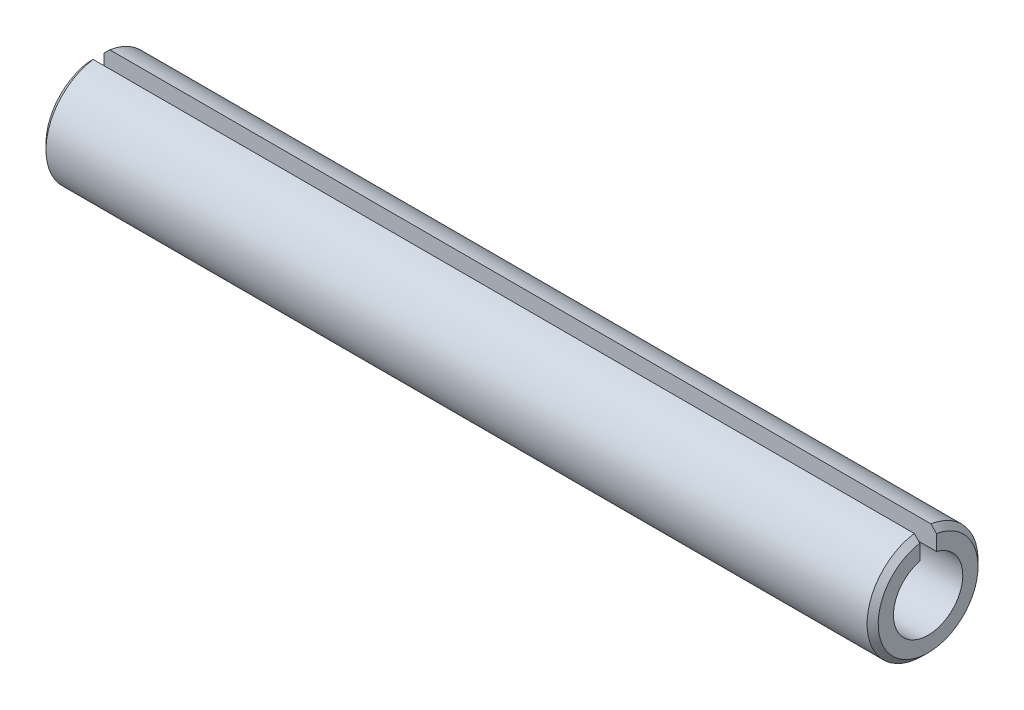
ISO-10303-21;
HEADER;
FILE_DESCRIPTION(('STEP AP214'),'2;1');
FILE_NAME('part.step','',(''),(''),'','','');
FILE_SCHEMA(('AUTOMOTIVE_DESIGN { 1 0 10303 214 1 1 1 1 }'));
ENDSEC;
DATA;
#1=APPLICATION_CONTEXT('core data for automotive mechanical design processes');
#2=APPLICATION_PROTOCOL_DEFINITION('international standard','automotive_design',2000,#1);
#3=PRODUCT_CONTEXT('',#1,'mechanical');
#4=PRODUCT('Part','Part','',(#3));
#5=PRODUCT_RELATED_PRODUCT_CATEGORY('part','',(#4));
#6=PRODUCT_DEFINITION_FORMATION('','',#4);
#7=PRODUCT_DEFINITION_CONTEXT('part definition',#1,'design');
#8=PRODUCT_DEFINITION('design','',#6,#7);
#9=PRODUCT_DEFINITION_SHAPE('','',#8);
#10=(LENGTH_UNIT() NAMED_UNIT(*) SI_UNIT(.MILLI.,.METRE.));
#11=(NAMED_UNIT(*) PLANE_ANGLE_UNIT() SI_UNIT($,.RADIAN.));
#12=(NAMED_UNIT(*) SI_UNIT($,.STERADIAN.) SOLID_ANGLE_UNIT());
#13=UNCERTAINTY_MEASURE_WITH_UNIT(LENGTH_MEASURE(1.E-05),#10,'distance_accuracy_value','');
#14=(GEOMETRIC_REPRESENTATION_CONTEXT(3) GLOBAL_UNCERTAINTY_ASSIGNED_CONTEXT((#13)) GLOBAL_UNIT_ASSIGNED_CONTEXT((#10,
#11,#12)) REPRESENTATION_CONTEXT('',''));
#15=CARTESIAN_POINT('',(0.,0.,0.));
#16=DIRECTION('',(0.,0.,1.));
#17=DIRECTION('',(1.,0.,0.));
#18=AXIS2_PLACEMENT_3D('',#15,#16,#17);
#19=CARTESIAN_POINT('',(0.,0.,0.));
#20=DIRECTION('',(-1.,0.,0.));
#21=DIRECTION('',(0.,0.,1.));
#22=AXIS2_PLACEMENT_3D('',#19,#20,#21);
#23=CYLINDRICAL_SURFACE('',#22,2.5);
#24=DIRECTION('',(-1.,0.,0.));
#25=VECTOR('',#24,1.);
#26=CARTESIAN_POINT('',(60.,2.42693221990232,0.6));
#27=LINE('',#26,#25);
#28=CARTESIAN_POINT('',(60.,2.42693221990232,0.6));
#29=VERTEX_POINT('',#28);
#30=CARTESIAN_POINT('',(0.,2.42693221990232,0.6));
#31=VERTEX_POINT('',#30);
#32=EDGE_CURVE('E45',#29,#31,#27,.T.);
#33=ORIENTED_EDGE('',*,*,#32,.F.);
#34=CARTESIAN_POINT('',(60.,0.,0.));
#35=DIRECTION('',(-1.,0.,0.));
#36=DIRECTION('',(0.,0.,1.));
#37=AXIS2_PLACEMENT_3D('',#34,#35,#36);
#38=CIRCLE('',#37,2.5);
#39=CARTESIAN_POINT('',(60.,2.42693221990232,-0.6));
#40=VERTEX_POINT('',#39);
#41=EDGE_CURVE('E87',#40,#29,#38,.T.);
#42=ORIENTED_EDGE('',*,*,#41,.F.);
#43=DIRECTION('',(-1.,0.,0.));
#44=VECTOR('',#43,1.);
#45=CARTESIAN_POINT('',(60.,2.42693221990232,-0.6));
#46=LINE('',#45,#44);
#47=CARTESIAN_POINT('',(0.,2.42693221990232,-0.6));
#48=VERTEX_POINT('',#47);
#49=EDGE_CURVE('E81',#40,#48,#46,.T.);
#50=ORIENTED_EDGE('',*,*,#49,.T.);
#51=CARTESIAN_POINT('',(0.,0.,0.));
#52=DIRECTION('',(-1.,0.,0.));
#53=DIRECTION('',(0.,0.,1.));
#54=AXIS2_PLACEMENT_3D('',#51,#52,#53);
#55=CIRCLE('',#54,2.5);
#56=EDGE_CURVE('E91',#48,#31,#55,.T.);
#57=ORIENTED_EDGE('',*,*,#56,.T.);
#58=EDGE_LOOP('',(#33,#42,#50,#57));
#59=FACE_BOUND('',#58,.T.);
#60=ADVANCED_FACE('F31',(#59),#23,.F.);
#61=CARTESIAN_POINT('',(60.,2.5,0.));
#62=DIRECTION('',(-1.,0.,0.));
#63=DIRECTION('',(0.,0.,1.));
#64=AXIS2_PLACEMENT_3D('',#61,#62,#63);
#65=PLANE('',#64);
#66=DIRECTION('',(0.,-1.,0.));
#67=VECTOR('',#66,1.);
#68=CARTESIAN_POINT('',(60.,3.95474398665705,0.6));
#69=LINE('',#68,#67);
#70=CARTESIAN_POINT('',(60.,3.54964786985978,0.6));
#71=VERTEX_POINT('',#70);
#72=EDGE_CURVE('E122',#71,#29,#69,.T.);
#73=ORIENTED_EDGE('',*,*,#72,.F.);
#74=CARTESIAN_POINT('',(60.,0.,0.));
#75=DIRECTION('',(-1.,0.,0.));
#76=DIRECTION('',(0.,0.,1.));
#77=AXIS2_PLACEMENT_3D('',#74,#75,#76);
#78=CIRCLE('',#77,3.60000000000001);
#79=CARTESIAN_POINT('',(60.,3.54964786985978,-0.6));
#80=VERTEX_POINT('',#79);
#81=EDGE_CURVE('E115',#80,#71,#78,.T.);
#82=ORIENTED_EDGE('',*,*,#81,.F.);
#83=DIRECTION('',(0.,-1.,0.));
#84=VECTOR('',#83,1.);
#85=CARTESIAN_POINT('',(60.,3.95474398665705,-0.6));
#86=LINE('',#85,#84);
#87=EDGE_CURVE('E123',#80,#40,#86,.T.);
#88=ORIENTED_EDGE('',*,*,#87,.T.);
#89=ORIENTED_EDGE('',*,*,#41,.T.);
#90=EDGE_LOOP('',(#73,#82,#88,#89));
#91=FACE_BOUND('',#90,.T.);
#92=ADVANCED_FACE('F120',(#91),#65,.F.);
#93=CARTESIAN_POINT('',(60.,0.,0.));
#94=DIRECTION('',(-1.,0.,0.));
#95=DIRECTION('',(0.,0.,1.));
#96=AXIS2_PLACEMENT_3D('',#93,#94,#95);
#97=CONICAL_SURFACE('',#96,3.60000000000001,0.785398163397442);
#98=CARTESIAN_POINT('',(57.8731044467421,5.6953781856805,0.6));
#99=CARTESIAN_POINT('',(58.0494236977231,5.51807770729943,0.6));
#100=CARTESIAN_POINT('',(58.2257027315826,5.34073717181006,0.6));
#101=CARTESIAN_POINT('',(58.5781365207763,4.98593500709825,0.6));
#102=CARTESIAN_POINT('',(58.7542912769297,4.8084733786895,0.6));
#103=CARTESIAN_POINT('',(59.1064277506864,4.45339301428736,0.6));
#104=CARTESIAN_POINT('',(59.2824094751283,4.27577428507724,0.6));
#105=CARTESIAN_POINT('',(59.6341356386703,3.92029946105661,0.6));
#106=CARTESIAN_POINT('',(59.809880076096,3.74244336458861,0.6));
#107=CARTESIAN_POINT('',(60.1610200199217,3.3863633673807,0.6));
#108=CARTESIAN_POINT('',(60.3364155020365,3.20813944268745,0.6));
#109=CARTESIAN_POINT('',(60.6866304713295,2.85113122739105,0.6));
#110=CARTESIAN_POINT('',(60.8614499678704,2.67234694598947,0.6));
#111=CARTESIAN_POINT('',(61.1229123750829,2.40341280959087,0.6));
#112=CARTESIAN_POINT('',(61.2099416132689,2.31363878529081,0.6));
#113=CARTESIAN_POINT('',(61.3836327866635,2.13373761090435,0.6));
#114=CARTESIAN_POINT('',(61.4702947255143,2.04361046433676,0.6));
#115=CARTESIAN_POINT('',(61.6430946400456,1.86284399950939,0.6));
#116=CARTESIAN_POINT('',(61.7292325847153,1.77220465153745,0.6));
#117=CARTESIAN_POINT('',(61.8578267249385,1.63566518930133,0.6));
#118=CARTESIAN_POINT('',(61.9005900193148,1.59005452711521,0.6));
#119=CARTESIAN_POINT('',(61.9858494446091,1.49858326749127,0.6));
#120=CARTESIAN_POINT('',(62.0283455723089,1.45272266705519,0.6));
#121=CARTESIAN_POINT('',(62.070676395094,1.40670916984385,0.6));
#122=B_SPLINE_CURVE_WITH_KNOTS('',3,(#98,#99,#100,#101,#102,#103,#104,#105,#106,#107,#108,#109,
#110,#111,#112,#113,#114,#115,#116,#117,#118,#119,#120,#121),.UNSPECIFIED.,.F.,.F.,(4,2,2,2,2,2,
2,2,2,2,2,4),(0.,0.750143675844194,1.50028235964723,2.2503900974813,3.0005031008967,
3.75066659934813,4.50081784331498,4.87591865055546,5.25101572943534,5.62613479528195,
5.81370060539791,6.00126867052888),.UNSPECIFIED.);
#123=CARTESIAN_POINT('',(59.6,3.95474398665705,0.6));
#124=VERTEX_POINT('',#123);
#125=EDGE_CURVE('E97',#124,#71,#122,.T.);
#126=ORIENTED_EDGE('',*,*,#125,.F.);
#127=CARTESIAN_POINT('',(59.6,0.,0.));
#128=DIRECTION('',(-1.,0.,0.));
#129=DIRECTION('',(0.,0.,1.));
#130=AXIS2_PLACEMENT_3D('',#127,#128,#129);
#131=CIRCLE('',#130,4.00000000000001);
#132=CARTESIAN_POINT('',(59.6,3.95474398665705,-0.6));
#133=VERTEX_POINT('',#132);
#134=EDGE_CURVE('E112',#133,#124,#131,.T.);
#135=ORIENTED_EDGE('',*,*,#134,.F.);
#136=CARTESIAN_POINT('',(57.8731044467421,5.6953781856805,-0.6));
#137=CARTESIAN_POINT('',(58.0494236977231,5.51807770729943,-0.6));
#138=CARTESIAN_POINT('',(58.2257027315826,5.34073717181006,-0.6));
#139=CARTESIAN_POINT('',(58.5781365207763,4.98593500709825,-0.6));
#140=CARTESIAN_POINT('',(58.7542912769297,4.8084733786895,-0.6));
#141=CARTESIAN_POINT('',(59.1064277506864,4.45339301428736,-0.6));
#142=CARTESIAN_POINT('',(59.2824094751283,4.27577428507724,-0.6));
#143=CARTESIAN_POINT('',(59.6341356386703,3.92029946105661,-0.6));
#144=CARTESIAN_POINT('',(59.809880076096,3.74244336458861,-0.6));
#145=CARTESIAN_POINT('',(60.1610200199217,3.3863633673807,-0.6));
#146=CARTESIAN_POINT('',(60.3364155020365,3.20813944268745,-0.6));
#147=CARTESIAN_POINT('',(60.6866304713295,2.85113122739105,-0.6));
#148=CARTESIAN_POINT('',(60.8614499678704,2.67234694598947,-0.6));
#149=CARTESIAN_POINT('',(61.1229123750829,2.40341280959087,-0.6));
#150=CARTESIAN_POINT('',(61.2099416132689,2.31363878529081,-0.6));
#151=CARTESIAN_POINT('',(61.3836327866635,2.13373761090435,-0.6));
#152=CARTESIAN_POINT('',(61.4702947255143,2.04361046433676,-0.6));
#153=CARTESIAN_POINT('',(61.6430946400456,1.86284399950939,-0.6));
#154=CARTESIAN_POINT('',(61.7292325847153,1.77220465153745,-0.6));
#155=CARTESIAN_POINT('',(61.8578267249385,1.63566518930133,-0.6));
#156=CARTESIAN_POINT('',(61.9005900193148,1.59005452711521,-0.6));
#157=CARTESIAN_POINT('',(61.9858494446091,1.49858326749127,-0.6));
#158=CARTESIAN_POINT('',(62.0283455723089,1.45272266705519,-0.6));
#159=CARTESIAN_POINT('',(62.070676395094,1.40670916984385,-0.6));
#160=B_SPLINE_CURVE_WITH_KNOTS('',3,(#136,#137,#138,#139,#140,#141,#142,#143,#144,#145,#146,
#147,#148,#149,#150,#151,#152,#153,#154,#155,#156,#157,#158,#159),.UNSPECIFIED.,.F.,.F.,(4,2,2,
2,2,2,2,2,2,2,2,4),(0.,0.750143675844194,1.50028235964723,2.2503900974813,3.0005031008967,
3.75066659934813,4.50081784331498,4.87591865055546,5.25101572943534,5.62613479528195,
5.81370060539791,6.00126867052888),.UNSPECIFIED.);
#161=EDGE_CURVE('E139',#133,#80,#160,.T.);
#162=ORIENTED_EDGE('',*,*,#161,.T.);
#163=ORIENTED_EDGE('',*,*,#81,.T.);
#164=EDGE_LOOP('',(#126,#135,#162,#163));
#165=FACE_BOUND('',#164,.T.);
#166=ADVANCED_FACE('F161',(#165),#97,.T.);
#167=CARTESIAN_POINT('',(0.,0.,0.));
#168=DIRECTION('',(-1.,0.,0.));
#169=DIRECTION('',(0.,0.,1.));
#170=AXIS2_PLACEMENT_3D('',#167,#168,#169);
#171=CYLINDRICAL_SURFACE('',#170,4.);
#172=DIRECTION('',(-1.,0.,0.));
#173=VECTOR('',#172,1.);
#174=CARTESIAN_POINT('',(60.,3.95474398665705,0.6));
#175=LINE('',#174,#173);
#176=CARTESIAN_POINT('',(0.4,3.95474398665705,0.6));
#177=VERTEX_POINT('',#176);
#178=EDGE_CURVE('E130',#124,#177,#175,.T.);
#179=ORIENTED_EDGE('',*,*,#178,.T.);
#180=CARTESIAN_POINT('',(0.399999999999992,0.,0.));
#181=DIRECTION('',(-1.,0.,0.));
#182=DIRECTION('',(0.,0.,1.));
#183=AXIS2_PLACEMENT_3D('',#180,#181,#182);
#184=CIRCLE('',#183,4.);
#185=CARTESIAN_POINT('',(0.4,3.95474398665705,-0.6));
#186=VERTEX_POINT('',#185);
#187=EDGE_CURVE('E99',#186,#177,#184,.T.);
#188=ORIENTED_EDGE('',*,*,#187,.F.);
#189=DIRECTION('',(-1.,0.,0.));
#190=VECTOR('',#189,1.);
#191=CARTESIAN_POINT('',(60.,3.95474398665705,-0.6));
#192=LINE('',#191,#190);
#193=EDGE_CURVE('E93',#133,#186,#192,.T.);
#194=ORIENTED_EDGE('',*,*,#193,.F.);
#195=ORIENTED_EDGE('',*,*,#134,.T.);
#196=EDGE_LOOP('',(#179,#188,#194,#195));
#197=FACE_BOUND('',#196,.T.);
#198=ADVANCED_FACE('F165',(#197),#171,.T.);
#199=CARTESIAN_POINT('',(0.399999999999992,0.,0.));
#200=DIRECTION('',(1.,0.,0.));
#201=DIRECTION('',(0.,0.,-1.));
#202=AXIS2_PLACEMENT_3D('',#199,#200,#201);
#203=CONICAL_SURFACE('',#202,4.,0.785398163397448);
#204=CARTESIAN_POINT('',(-2.07067639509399,1.40670916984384,0.6));
#205=CARTESIAN_POINT('',(-2.02011415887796,1.46166506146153,0.6));
#206=CARTESIAN_POINT('',(-1.9693200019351,1.51640610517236,0.6));
#207=CARTESIAN_POINT('',(-1.86736787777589,1.62554685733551,0.6));
#208=CARTESIAN_POINT('',(-1.81620991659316,1.67994657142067,0.6));
#209=CARTESIAN_POINT('',(-1.66234187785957,1.84276470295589,0.6));
#210=CARTESIAN_POINT('',(-1.55923365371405,1.95080641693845,0.6));
#211=CARTESIAN_POINT('',(-1.35237956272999,2.16626307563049,0.6));
#212=CARTESIAN_POINT('',(-1.24863373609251,2.27367805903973,0.6));
#213=CARTESIAN_POINT('',(-1.04071524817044,2.48809612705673,0.6));
#214=CARTESIAN_POINT('',(-0.9365425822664,2.59509920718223,0.6));
#215=CARTESIAN_POINT('',(-0.691507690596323,2.84610384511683,0.6));
#216=CARTESIAN_POINT('',(-0.550525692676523,2.98998839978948,0.6));
#217=CARTESIAN_POINT('',(-0.268216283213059,3.27742366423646,0.6));
#218=CARTESIAN_POINT('',(-0.126888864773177,3.42097436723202,0.6));
#219=CARTESIAN_POINT('',(0.190127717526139,3.74245168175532,0.6));
#220=CARTESIAN_POINT('',(0.365880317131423,3.92031572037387,0.6));
#221=CARTESIAN_POINT('',(0.717623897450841,4.2758078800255,0.6));
#222=CARTESIAN_POINT('',(0.89361487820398,4.45343600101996,0.6));
#223=CARTESIAN_POINT('',(1.24575266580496,4.80851768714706,0.6));
#224=CARTESIAN_POINT('',(1.42189946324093,4.9859712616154,0.6));
#225=CARTESIAN_POINT('',(1.77431596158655,5.34075596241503,0.6));
#226=CARTESIAN_POINT('',(1.95058566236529,5.51808708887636,0.6));
#227=CARTESIAN_POINT('',(2.1268955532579,5.69537818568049,0.6));
#228=B_SPLINE_CURVE_WITH_KNOTS('',3,(#204,#205,#206,#207,#208,#209,#210,#211,#212,#213,#214,
#215,#216,#217,#218,#219,#220,#221,#222,#223,#224,#225,#226,#227),.UNSPECIFIED.,.F.,.F.,(4,2,2,
2,2,2,2,2,2,2,2,4),(0.,0.224029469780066,0.448055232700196,0.896089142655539,1.3440950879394,
1.79210589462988,2.39642954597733,3.00076536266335,3.75091253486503,4.50105982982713,
5.25116454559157,6.00126846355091),.UNSPECIFIED.);
#229=CARTESIAN_POINT('',(0.,3.54964786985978,0.6));
#230=VERTEX_POINT('',#229);
#231=EDGE_CURVE('E101',#230,#177,#228,.T.);
#232=ORIENTED_EDGE('',*,*,#231,.F.);
#233=CARTESIAN_POINT('',(0.,0.,0.));
#234=DIRECTION('',(-1.,0.,0.));
#235=DIRECTION('',(0.,0.,1.));
#236=AXIS2_PLACEMENT_3D('',#233,#234,#235);
#237=CIRCLE('',#236,3.60000000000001);
#238=CARTESIAN_POINT('',(0.,3.54964786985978,-0.6));
#239=VERTEX_POINT('',#238);
#240=EDGE_CURVE('E96',#239,#230,#237,.T.);
#241=ORIENTED_EDGE('',*,*,#240,.F.);
#242=CARTESIAN_POINT('',(-2.07067639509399,1.40670916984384,-0.6));
#243=CARTESIAN_POINT('',(-2.02011415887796,1.46166506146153,-0.6));
#244=CARTESIAN_POINT('',(-1.9693200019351,1.51640610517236,-0.6));
#245=CARTESIAN_POINT('',(-1.86736787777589,1.62554685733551,-0.6));
#246=CARTESIAN_POINT('',(-1.81620991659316,1.67994657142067,-0.6));
#247=CARTESIAN_POINT('',(-1.66234187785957,1.84276470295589,-0.6));
#248=CARTESIAN_POINT('',(-1.55923365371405,1.95080641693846,-0.6));
#249=CARTESIAN_POINT('',(-1.35237956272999,2.16626307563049,-0.6));
#250=CARTESIAN_POINT('',(-1.24863373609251,2.27367805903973,-0.6));
#251=CARTESIAN_POINT('',(-1.04071524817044,2.48809612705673,-0.6));
#252=CARTESIAN_POINT('',(-0.9365425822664,2.59509920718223,-0.6));
#253=CARTESIAN_POINT('',(-0.691507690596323,2.84610384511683,-0.6));
#254=CARTESIAN_POINT('',(-0.550525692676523,2.98998839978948,-0.6));
#255=CARTESIAN_POINT('',(-0.268216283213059,3.27742366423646,-0.6));
#256=CARTESIAN_POINT('',(-0.126888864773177,3.42097436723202,-0.6));
#257=CARTESIAN_POINT('',(0.190127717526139,3.74245168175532,-0.6));
#258=CARTESIAN_POINT('',(0.365880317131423,3.92031572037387,-0.6));
#259=CARTESIAN_POINT('',(0.717623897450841,4.2758078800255,-0.6));
#260=CARTESIAN_POINT('',(0.89361487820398,4.45343600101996,-0.6));
#261=CARTESIAN_POINT('',(1.24575266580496,4.80851768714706,-0.6));
#262=CARTESIAN_POINT('',(1.42189946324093,4.9859712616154,-0.6));
#263=CARTESIAN_POINT('',(1.77431596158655,5.34075596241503,-0.6));
#264=CARTESIAN_POINT('',(1.95058566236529,5.51808708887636,-0.6));
#265=CARTESIAN_POINT('',(2.1268955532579,5.69537818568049,-0.6));
#266=B_SPLINE_CURVE_WITH_KNOTS('',3,(#242,#243,#244,#245,#246,#247,#248,#249,#250,#251,#252,
#253,#254,#255,#256,#257,#258,#259,#260,#261,#262,#263,#264,#265),.UNSPECIFIED.,.F.,.F.,(4,2,2,
2,2,2,2,2,2,2,2,4),(0.,0.224029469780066,0.448055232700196,0.896089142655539,1.3440950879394,
1.79210589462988,2.39642954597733,3.00076536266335,3.75091253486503,4.50105982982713,
5.25116454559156,6.00126846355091),.UNSPECIFIED.);
#267=EDGE_CURVE('E52',#239,#186,#266,.T.);
#268=ORIENTED_EDGE('',*,*,#267,.T.);
#269=ORIENTED_EDGE('',*,*,#187,.T.);
#270=EDGE_LOOP('',(#232,#241,#268,#269));
#271=FACE_BOUND('',#270,.T.);
#272=ADVANCED_FACE('F143',(#271),#203,.T.);
#273=CARTESIAN_POINT('',(0.,2.5,0.));
#274=DIRECTION('',(-1.,0.,0.));
#275=DIRECTION('',(0.,0.,1.));
#276=AXIS2_PLACEMENT_3D('',#273,#274,#275);
#277=PLANE('',#276);
#278=ORIENTED_EDGE('',*,*,#240,.T.);
#279=DIRECTION('',(0.,-1.,0.));
#280=VECTOR('',#279,1.);
#281=CARTESIAN_POINT('',(0.,2.5,0.6));
#282=LINE('',#281,#280);
#283=EDGE_CURVE('E11',#230,#31,#282,.T.);
#284=ORIENTED_EDGE('',*,*,#283,.T.);
#285=ORIENTED_EDGE('',*,*,#56,.F.);
#286=DIRECTION('',(0.,-1.,0.));
#287=VECTOR('',#286,1.);
#288=CARTESIAN_POINT('',(0.,2.5,-0.6));
#289=LINE('',#288,#287);
#290=EDGE_CURVE('E38',#239,#48,#289,.T.);
#291=ORIENTED_EDGE('',*,*,#290,.F.);
#292=EDGE_LOOP('',(#278,#284,#285,#291));
#293=FACE_BOUND('',#292,.T.);
#294=ADVANCED_FACE('F95',(#293),#277,.T.);
#295=CARTESIAN_POINT('',(60.,3.95474398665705,-0.6));
#296=DIRECTION('',(0.,0.,-1.));
#297=DIRECTION('',(0.,1.,0.));
#298=AXIS2_PLACEMENT_3D('',#295,#296,#297);
#299=PLANE('',#298);
#300=ORIENTED_EDGE('',*,*,#193,.T.);
#301=ORIENTED_EDGE('',*,*,#267,.F.);
#302=ORIENTED_EDGE('',*,*,#290,.T.);
#303=ORIENTED_EDGE('',*,*,#49,.F.);
#304=ORIENTED_EDGE('',*,*,#87,.F.);
#305=ORIENTED_EDGE('',*,*,#161,.F.);
#306=EDGE_LOOP('',(#300,#301,#302,#303,#304,#305));
#307=FACE_BOUND('',#306,.T.);
#308=ADVANCED_FACE('F80',(#307),#299,.F.);
#309=CARTESIAN_POINT('',(60.,3.95474398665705,0.6));
#310=DIRECTION('',(0.,0.,-1.));
#311=DIRECTION('',(0.,1.,0.));
#312=AXIS2_PLACEMENT_3D('',#309,#310,#311);
#313=PLANE('',#312);
#314=ORIENTED_EDGE('',*,*,#125,.T.);
#315=ORIENTED_EDGE('',*,*,#72,.T.);
#316=ORIENTED_EDGE('',*,*,#32,.T.);
#317=ORIENTED_EDGE('',*,*,#283,.F.);
#318=ORIENTED_EDGE('',*,*,#231,.T.);
#319=ORIENTED_EDGE('',*,*,#178,.F.);
#320=EDGE_LOOP('',(#314,#315,#316,#317,#318,#319));
#321=FACE_BOUND('',#320,.T.);
#322=ADVANCED_FACE('F149',(#321),#313,.T.);
#323=CLOSED_SHELL('',(#60,#92,#166,#198,#272,#294,#308,#322));
#324=MANIFOLD_SOLID_BREP('B2',#323);
#325=ADVANCED_BREP_SHAPE_REPRESENTATION('',(#18,#324),#14);
#326=SHAPE_DEFINITION_REPRESENTATION(#9,#325);
ENDSEC;
END-ISO-10303-21;
